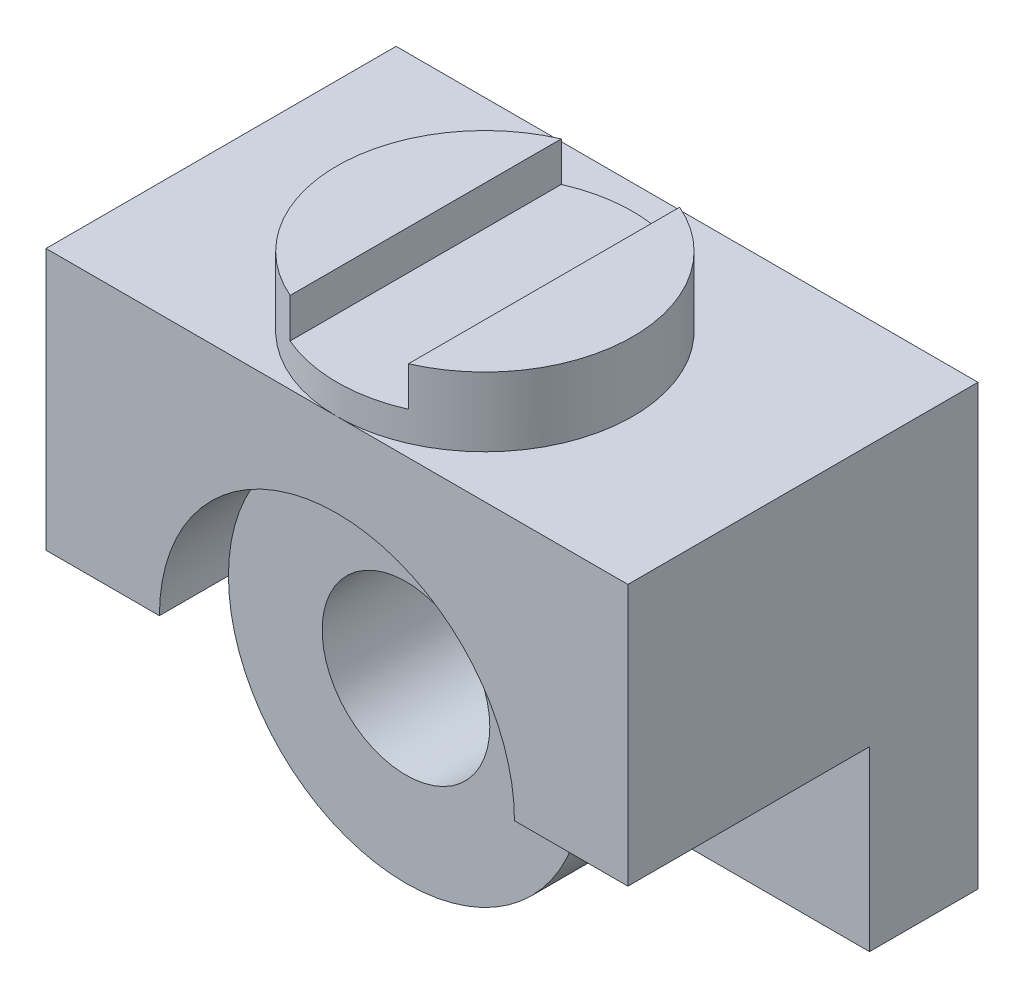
ISO-10303-21;
HEADER;
FILE_DESCRIPTION(('STEP AP214'),'2;1');
FILE_NAME('part.step','',(''),(''),'','','');
FILE_SCHEMA(('AUTOMOTIVE_DESIGN { 1 0 10303 214 1 1 1 1 }'));
ENDSEC;
DATA;
#1=APPLICATION_CONTEXT('core data for automotive mechanical design processes');
#2=APPLICATION_PROTOCOL_DEFINITION('international standard','automotive_design',2000,#1);
#3=PRODUCT_CONTEXT('',#1,'mechanical');
#4=PRODUCT('Part','Part','',(#3));
#5=PRODUCT_RELATED_PRODUCT_CATEGORY('part','',(#4));
#6=PRODUCT_DEFINITION_FORMATION('','',#4);
#7=PRODUCT_DEFINITION_CONTEXT('part definition',#1,'design');
#8=PRODUCT_DEFINITION('design','',#6,#7);
#9=PRODUCT_DEFINITION_SHAPE('','',#8);
#10=(LENGTH_UNIT() NAMED_UNIT(*) SI_UNIT(.MILLI.,.METRE.));
#11=(NAMED_UNIT(*) PLANE_ANGLE_UNIT() SI_UNIT($,.RADIAN.));
#12=(NAMED_UNIT(*) SI_UNIT($,.STERADIAN.) SOLID_ANGLE_UNIT());
#13=UNCERTAINTY_MEASURE_WITH_UNIT(LENGTH_MEASURE(1.E-05),#10,'distance_accuracy_value','');
#14=(GEOMETRIC_REPRESENTATION_CONTEXT(3) GLOBAL_UNCERTAINTY_ASSIGNED_CONTEXT((#13)) GLOBAL_UNIT_ASSIGNED_CONTEXT((#10,
#11,#12)) REPRESENTATION_CONTEXT('',''));
#15=CARTESIAN_POINT('',(0.,0.,0.));
#16=DIRECTION('',(0.,0.,1.));
#17=DIRECTION('',(1.,0.,0.));
#18=AXIS2_PLACEMENT_3D('',#15,#16,#17);
#19=CARTESIAN_POINT('',(0.,134.,0.));
#20=DIRECTION('',(0.,1.,0.));
#21=DIRECTION('',(-1.,0.,0.));
#22=AXIS2_PLACEMENT_3D('',#19,#20,#21);
#23=PLANE('',#22);
#24=DIRECTION('',(0.,0.,-1.));
#25=VECTOR('',#24,1.);
#26=CARTESIAN_POINT('',(24.,134.,0.));
#27=LINE('',#26,#25);
#28=CARTESIAN_POINT('',(24.,134.,54.99090833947));
#29=VERTEX_POINT('',#28);
#30=CARTESIAN_POINT('',(24.,134.,-54.9909083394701));
#31=VERTEX_POINT('',#30);
#32=EDGE_CURVE('E246',#29,#31,#27,.T.);
#33=ORIENTED_EDGE('',*,*,#32,.F.);
#34=CARTESIAN_POINT('',(0.,134.,0.));
#35=DIRECTION('',(0.,1.,0.));
#36=DIRECTION('',(-1.,0.,0.));
#37=AXIS2_PLACEMENT_3D('',#34,#35,#36);
#38=CIRCLE('',#37,60.);
#39=EDGE_CURVE('E160',#29,#31,#38,.T.);
#40=ORIENTED_EDGE('',*,*,#39,.T.);
#41=EDGE_LOOP('',(#33,#40));
#42=FACE_BOUND('',#41,.T.);
#43=ADVANCED_FACE('F31',(#42),#23,.T.);
#44=CARTESIAN_POINT('',(0.,0.,-82.));
#45=DIRECTION('',(0.,0.,1.));
#46=DIRECTION('',(1.,0.,0.));
#47=AXIS2_PLACEMENT_3D('',#44,#45,#46);
#48=CYLINDRICAL_SURFACE('',#47,34.);
#49=CARTESIAN_POINT('',(0.,0.,-82.));
#50=DIRECTION('',(0.,0.,1.));
#51=DIRECTION('',(1.,0.,0.));
#52=AXIS2_PLACEMENT_3D('',#49,#50,#51);
#53=CIRCLE('',#52,34.);
#54=CARTESIAN_POINT('',(34.,0.,-82.));
#55=VERTEX_POINT('',#54);
#56=EDGE_CURVE('E208',#55,#55,#53,.T.);
#57=ORIENTED_EDGE('',*,*,#56,.F.);
#58=EDGE_LOOP('',(#57));
#59=FACE_BOUND('',#58,.T.);
#60=CARTESIAN_POINT('',(0.,0.,32.));
#61=DIRECTION('',(0.,0.,1.));
#62=DIRECTION('',(1.,0.,0.));
#63=AXIS2_PLACEMENT_3D('',#60,#61,#62);
#64=CIRCLE('',#63,34.);
#65=CARTESIAN_POINT('',(34.,0.,32.));
#66=VERTEX_POINT('',#65);
#67=EDGE_CURVE('E163',#66,#66,#64,.T.);
#68=ORIENTED_EDGE('',*,*,#67,.T.);
#69=EDGE_LOOP('',(#68));
#70=FACE_BOUND('',#69,.T.);
#71=ADVANCED_FACE('F254',(#59,#70),#48,.F.);
#72=CARTESIAN_POINT('',(0.,0.,-38.));
#73=DIRECTION('',(0.,0.,1.));
#74=DIRECTION('',(1.,0.,0.));
#75=AXIS2_PLACEMENT_3D('',#72,#73,#74);
#76=CYLINDRICAL_SURFACE('',#75,72.);
#77=DIRECTION('',(0.,0.,1.));
#78=VECTOR('',#77,1.);
#79=CARTESIAN_POINT('',(72.,0.,-38.));
#80=LINE('',#79,#78);
#81=CARTESIAN_POINT('',(72.,0.,-38.));
#82=VERTEX_POINT('',#81);
#83=CARTESIAN_POINT('',(72.,0.,32.));
#84=VERTEX_POINT('',#83);
#85=EDGE_CURVE('E177',#82,#84,#80,.T.);
#86=ORIENTED_EDGE('',*,*,#85,.T.);
#87=CARTESIAN_POINT('',(0.,0.,32.));
#88=DIRECTION('',(0.,0.,1.));
#89=DIRECTION('',(1.,0.,0.));
#90=AXIS2_PLACEMENT_3D('',#87,#88,#89);
#91=CIRCLE('',#90,72.);
#92=CARTESIAN_POINT('',(-72.,0.,32.));
#93=VERTEX_POINT('',#92);
#94=EDGE_CURVE('E166',#93,#84,#91,.T.);
#95=ORIENTED_EDGE('',*,*,#94,.F.);
#96=DIRECTION('',(0.,0.,1.));
#97=VECTOR('',#96,1.);
#98=CARTESIAN_POINT('',(-72.,0.,-38.));
#99=LINE('',#98,#97);
#100=CARTESIAN_POINT('',(-72.,0.,-38.));
#101=VERTEX_POINT('',#100);
#102=EDGE_CURVE('E202',#101,#93,#99,.T.);
#103=ORIENTED_EDGE('',*,*,#102,.F.);
#104=CARTESIAN_POINT('',(0.,0.,-38.));
#105=DIRECTION('',(0.,0.,1.));
#106=DIRECTION('',(1.,0.,0.));
#107=AXIS2_PLACEMENT_3D('',#104,#105,#106);
#108=CIRCLE('',#107,72.);
#109=CARTESIAN_POINT('',(0.,-72.,-38.));
#110=VERTEX_POINT('',#109);
#111=EDGE_CURVE('E192',#101,#110,#108,.T.);
#112=ORIENTED_EDGE('',*,*,#111,.T.);
#113=CARTESIAN_POINT('',(0.,0.,-38.));
#114=DIRECTION('',(0.,0.,1.));
#115=DIRECTION('',(1.,0.,0.));
#116=AXIS2_PLACEMENT_3D('',#113,#114,#115);
#117=CIRCLE('',#116,72.);
#118=EDGE_CURVE('E186',#110,#82,#117,.T.);
#119=ORIENTED_EDGE('',*,*,#118,.T.);
#120=EDGE_LOOP('',(#86,#95,#103,#112,#119));
#121=FACE_BOUND('',#120,.T.);
#122=ADVANCED_FACE('F260',(#121),#76,.T.);
#123=CARTESIAN_POINT('',(-118.,-72.,60.));
#124=DIRECTION('',(0.,0.,1.));
#125=DIRECTION('',(1.,0.,0.));
#126=AXIS2_PLACEMENT_3D('',#123,#124,#125);
#127=PLANE('',#126);
#128=CARTESIAN_POINT('',(0.,0.,60.));
#129=DIRECTION('',(0.,0.,1.));
#130=DIRECTION('',(1.,0.,0.));
#131=AXIS2_PLACEMENT_3D('',#128,#129,#130);
#132=CIRCLE('',#131,72.);
#133=CARTESIAN_POINT('',(72.,0.,60.));
#134=VERTEX_POINT('',#133);
#135=CARTESIAN_POINT('',(-72.,0.,60.));
#136=VERTEX_POINT('',#135);
#137=EDGE_CURVE('E167',#134,#136,#132,.T.);
#138=ORIENTED_EDGE('',*,*,#137,.F.);
#139=DIRECTION('',(1.,0.,0.));
#140=VECTOR('',#139,1.);
#141=CARTESIAN_POINT('',(0.,0.,60.));
#142=LINE('',#141,#140);
#143=CARTESIAN_POINT('',(118.,0.,60.));
#144=VERTEX_POINT('',#143);
#145=EDGE_CURVE('E172',#134,#144,#142,.T.);
#146=ORIENTED_EDGE('',*,*,#145,.T.);
#147=DIRECTION('',(0.,1.,0.));
#148=VECTOR('',#147,1.);
#149=CARTESIAN_POINT('',(118.,106.,60.));
#150=LINE('',#149,#148);
#151=CARTESIAN_POINT('',(118.,106.,60.));
#152=VERTEX_POINT('',#151);
#153=EDGE_CURVE('E216',#144,#152,#150,.T.);
#154=ORIENTED_EDGE('',*,*,#153,.T.);
#155=DIRECTION('',(-1.,0.,0.));
#156=VECTOR('',#155,1.);
#157=CARTESIAN_POINT('',(-118.,106.,60.));
#158=LINE('',#157,#156);
#159=CARTESIAN_POINT('',(0.,106.,60.));
#160=VERTEX_POINT('',#159);
#161=EDGE_CURVE('E219',#152,#160,#158,.T.);
#162=ORIENTED_EDGE('',*,*,#161,.T.);
#163=CARTESIAN_POINT('',(-118.,106.,60.));
#164=VERTEX_POINT('',#163);
#165=EDGE_CURVE('E218',#160,#164,#158,.T.);
#166=ORIENTED_EDGE('',*,*,#165,.T.);
#167=DIRECTION('',(0.,-1.,0.));
#168=VECTOR('',#167,1.);
#169=CARTESIAN_POINT('',(-118.,106.,60.));
#170=LINE('',#169,#168);
#171=CARTESIAN_POINT('',(-118.,0.,60.));
#172=VERTEX_POINT('',#171);
#173=EDGE_CURVE('E213',#164,#172,#170,.T.);
#174=ORIENTED_EDGE('',*,*,#173,.T.);
#175=DIRECTION('',(1.,0.,0.));
#176=VECTOR('',#175,1.);
#177=CARTESIAN_POINT('',(0.,0.,60.));
#178=LINE('',#177,#176);
#179=EDGE_CURVE('E185',#172,#136,#178,.T.);
#180=ORIENTED_EDGE('',*,*,#179,.T.);
#181=EDGE_LOOP('',(#138,#146,#154,#162,#166,#174,#180));
#182=FACE_BOUND('',#181,.T.);
#183=ADVANCED_FACE('F300',(#182),#127,.T.);
#184=CARTESIAN_POINT('',(118.,106.,-82.));
#185=DIRECTION('',(1.,0.,0.));
#186=DIRECTION('',(0.,1.,0.));
#187=AXIS2_PLACEMENT_3D('',#184,#185,#186);
#188=PLANE('',#187);
#189=ORIENTED_EDGE('',*,*,#153,.F.);
#190=DIRECTION('',(0.,0.,1.));
#191=VECTOR('',#190,1.);
#192=CARTESIAN_POINT('',(118.,0.,-38.));
#193=LINE('',#192,#191);
#194=CARTESIAN_POINT('',(118.,0.,-38.));
#195=VERTEX_POINT('',#194);
#196=EDGE_CURVE('E173',#195,#144,#193,.T.);
#197=ORIENTED_EDGE('',*,*,#196,.F.);
#198=DIRECTION('',(0.,1.,0.));
#199=VECTOR('',#198,1.);
#200=CARTESIAN_POINT('',(118.,-213.06510434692,-38.));
#201=LINE('',#200,#199);
#202=CARTESIAN_POINT('',(118.,-72.,-38.));
#203=VERTEX_POINT('',#202);
#204=EDGE_CURVE('E176',#203,#195,#201,.T.);
#205=ORIENTED_EDGE('',*,*,#204,.F.);
#206=DIRECTION('',(0.,0.,1.));
#207=VECTOR('',#206,1.);
#208=CARTESIAN_POINT('',(118.,-72.,-82.));
#209=LINE('',#208,#207);
#210=CARTESIAN_POINT('',(118.,-72.,-82.));
#211=VERTEX_POINT('',#210);
#212=EDGE_CURVE('E241',#211,#203,#209,.T.);
#213=ORIENTED_EDGE('',*,*,#212,.F.);
#214=DIRECTION('',(0.,1.,0.));
#215=VECTOR('',#214,1.);
#216=CARTESIAN_POINT('',(118.,106.,-82.));
#217=LINE('',#216,#215);
#218=CARTESIAN_POINT('',(118.,106.,-82.));
#219=VERTEX_POINT('',#218);
#220=EDGE_CURVE('E227',#211,#219,#217,.T.);
#221=ORIENTED_EDGE('',*,*,#220,.T.);
#222=DIRECTION('',(0.,0.,1.));
#223=VECTOR('',#222,1.);
#224=CARTESIAN_POINT('',(118.,106.,-82.));
#225=LINE('',#224,#223);
#226=EDGE_CURVE('E238',#219,#152,#225,.T.);
#227=ORIENTED_EDGE('',*,*,#226,.T.);
#228=EDGE_LOOP('',(#189,#197,#205,#213,#221,#227));
#229=FACE_BOUND('',#228,.T.);
#230=ADVANCED_FACE('F305',(#229),#188,.T.);
#231=CARTESIAN_POINT('',(-118.,-72.,-82.));
#232=DIRECTION('',(0.,-1.,0.));
#233=DIRECTION('',(1.,0.,0.));
#234=AXIS2_PLACEMENT_3D('',#231,#232,#233);
#235=PLANE('',#234);
#236=ORIENTED_EDGE('',*,*,#212,.T.);
#237=DIRECTION('',(1.,0.,0.));
#238=VECTOR('',#237,1.);
#239=CARTESIAN_POINT('',(0.,-72.,-38.));
#240=LINE('',#239,#238);
#241=EDGE_CURVE('E175',#110,#203,#240,.T.);
#242=ORIENTED_EDGE('',*,*,#241,.F.);
#243=DIRECTION('',(1.,0.,0.));
#244=VECTOR('',#243,1.);
#245=CARTESIAN_POINT('',(0.,-72.,-38.));
#246=LINE('',#245,#244);
#247=CARTESIAN_POINT('',(-118.,-72.,-38.));
#248=VERTEX_POINT('',#247);
#249=EDGE_CURVE('E199',#248,#110,#246,.T.);
#250=ORIENTED_EDGE('',*,*,#249,.F.);
#251=DIRECTION('',(0.,0.,1.));
#252=VECTOR('',#251,1.);
#253=CARTESIAN_POINT('',(-118.,-72.,-82.));
#254=LINE('',#253,#252);
#255=CARTESIAN_POINT('',(-118.,-72.,-82.));
#256=VERTEX_POINT('',#255);
#257=EDGE_CURVE('E233',#256,#248,#254,.T.);
#258=ORIENTED_EDGE('',*,*,#257,.F.);
#259=DIRECTION('',(1.,0.,0.));
#260=VECTOR('',#259,1.);
#261=CARTESIAN_POINT('',(-118.,-72.,-82.));
#262=LINE('',#261,#260);
#263=EDGE_CURVE('E224',#256,#211,#262,.T.);
#264=ORIENTED_EDGE('',*,*,#263,.T.);
#265=EDGE_LOOP('',(#236,#242,#250,#258,#264));
#266=FACE_BOUND('',#265,.T.);
#267=ADVANCED_FACE('F315',(#266),#235,.T.);
#268=CARTESIAN_POINT('',(-118.,106.,-82.));
#269=DIRECTION('',(-1.,0.,0.));
#270=DIRECTION('',(0.,-1.,0.));
#271=AXIS2_PLACEMENT_3D('',#268,#269,#270);
#272=PLANE('',#271);
#273=DIRECTION('',(0.,-1.,0.));
#274=VECTOR('',#273,1.);
#275=CARTESIAN_POINT('',(-118.,-213.06510434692,-38.));
#276=LINE('',#275,#274);
#277=CARTESIAN_POINT('',(-118.,0.,-38.));
#278=VERTEX_POINT('',#277);
#279=EDGE_CURVE('E197',#278,#248,#276,.T.);
#280=ORIENTED_EDGE('',*,*,#279,.F.);
#281=DIRECTION('',(0.,0.,1.));
#282=VECTOR('',#281,1.);
#283=CARTESIAN_POINT('',(-118.,0.,-38.));
#284=LINE('',#283,#282);
#285=EDGE_CURVE('E205',#278,#172,#284,.T.);
#286=ORIENTED_EDGE('',*,*,#285,.T.);
#287=ORIENTED_EDGE('',*,*,#173,.F.);
#288=DIRECTION('',(0.,0.,1.));
#289=VECTOR('',#288,1.);
#290=CARTESIAN_POINT('',(-118.,106.,-82.));
#291=LINE('',#290,#289);
#292=CARTESIAN_POINT('',(-118.,106.,-82.));
#293=VERTEX_POINT('',#292);
#294=EDGE_CURVE('E234',#293,#164,#291,.T.);
#295=ORIENTED_EDGE('',*,*,#294,.F.);
#296=DIRECTION('',(0.,-1.,0.));
#297=VECTOR('',#296,1.);
#298=CARTESIAN_POINT('',(-118.,106.,-82.));
#299=LINE('',#298,#297);
#300=EDGE_CURVE('E221',#293,#256,#299,.T.);
#301=ORIENTED_EDGE('',*,*,#300,.T.);
#302=ORIENTED_EDGE('',*,*,#257,.T.);
#303=EDGE_LOOP('',(#280,#286,#287,#295,#301,#302));
#304=FACE_BOUND('',#303,.T.);
#305=ADVANCED_FACE('F33',(#304),#272,.T.);
#306=CARTESIAN_POINT('',(-118.,106.,-82.));
#307=DIRECTION('',(0.,1.,0.));
#308=DIRECTION('',(-1.,0.,0.));
#309=AXIS2_PLACEMENT_3D('',#306,#307,#308);
#310=PLANE('',#309);
#311=ORIENTED_EDGE('',*,*,#165,.F.);
#312=CARTESIAN_POINT('',(0.,106.,0.));
#313=DIRECTION('',(0.,1.,0.));
#314=DIRECTION('',(-1.,0.,0.));
#315=AXIS2_PLACEMENT_3D('',#312,#313,#314);
#316=CIRCLE('',#315,60.);
#317=EDGE_CURVE('E158',#160,#160,#316,.T.);
#318=ORIENTED_EDGE('',*,*,#317,.F.);
#319=ORIENTED_EDGE('',*,*,#161,.F.);
#320=ORIENTED_EDGE('',*,*,#226,.F.);
#321=DIRECTION('',(-1.,0.,0.));
#322=VECTOR('',#321,1.);
#323=CARTESIAN_POINT('',(-118.,106.,-82.));
#324=LINE('',#323,#322);
#325=EDGE_CURVE('E230',#219,#293,#324,.T.);
#326=ORIENTED_EDGE('',*,*,#325,.T.);
#327=ORIENTED_EDGE('',*,*,#294,.T.);
#328=EDGE_LOOP('',(#311,#318,#319,#320,#326,#327));
#329=FACE_BOUND('',#328,.T.);
#330=ADVANCED_FACE('F309',(#329),#310,.T.);
#331=CARTESIAN_POINT('',(-118.,-72.,-82.));
#332=DIRECTION('',(0.,0.,1.));
#333=DIRECTION('',(1.,0.,0.));
#334=AXIS2_PLACEMENT_3D('',#331,#332,#333);
#335=PLANE('',#334);
#336=ORIENTED_EDGE('',*,*,#56,.T.);
#337=EDGE_LOOP('',(#336));
#338=FACE_BOUND('',#337,.T.);
#339=ORIENTED_EDGE('',*,*,#300,.F.);
#340=ORIENTED_EDGE('',*,*,#325,.F.);
#341=ORIENTED_EDGE('',*,*,#220,.F.);
#342=ORIENTED_EDGE('',*,*,#263,.F.);
#343=EDGE_LOOP('',(#339,#340,#341,#342));
#344=FACE_BOUND('',#343,.T.);
#345=ADVANCED_FACE('F297',(#338,#344),#335,.F.);
#346=CARTESIAN_POINT('',(0.,0.,-38.));
#347=DIRECTION('',(0.,-1.,0.));
#348=DIRECTION('',(0.,0.,-1.));
#349=AXIS2_PLACEMENT_3D('',#346,#347,#348);
#350=PLANE('',#349);
#351=ORIENTED_EDGE('',*,*,#179,.F.);
#352=ORIENTED_EDGE('',*,*,#285,.F.);
#353=DIRECTION('',(1.,0.,0.));
#354=VECTOR('',#353,1.);
#355=CARTESIAN_POINT('',(0.,0.,-38.));
#356=LINE('',#355,#354);
#357=EDGE_CURVE('E195',#278,#101,#356,.T.);
#358=ORIENTED_EDGE('',*,*,#357,.T.);
#359=ORIENTED_EDGE('',*,*,#102,.T.);
#360=DIRECTION('',(0.,0.,1.));
#361=VECTOR('',#360,1.);
#362=CARTESIAN_POINT('',(-72.,0.,32.));
#363=LINE('',#362,#361);
#364=EDGE_CURVE('E169',#136,#93,#363,.F.);
#365=ORIENTED_EDGE('',*,*,#364,.F.);
#366=EDGE_LOOP('',(#351,#352,#358,#359,#365));
#367=FACE_BOUND('',#366,.T.);
#368=ADVANCED_FACE('F293',(#367),#350,.T.);
#369=CARTESIAN_POINT('',(0.,-213.06510434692,-38.));
#370=DIRECTION('',(0.,0.,1.));
#371=DIRECTION('',(1.,0.,0.));
#372=AXIS2_PLACEMENT_3D('',#369,#370,#371);
#373=PLANE('',#372);
#374=ORIENTED_EDGE('',*,*,#111,.F.);
#375=ORIENTED_EDGE('',*,*,#357,.F.);
#376=ORIENTED_EDGE('',*,*,#279,.T.);
#377=ORIENTED_EDGE('',*,*,#249,.T.);
#378=EDGE_LOOP('',(#374,#375,#376,#377));
#379=FACE_BOUND('',#378,.T.);
#380=ADVANCED_FACE('F286',(#379),#373,.T.);
#381=CARTESIAN_POINT('',(0.,0.,-38.));
#382=DIRECTION('',(0.,-1.,0.));
#383=DIRECTION('',(0.,0.,-1.));
#384=AXIS2_PLACEMENT_3D('',#381,#382,#383);
#385=PLANE('',#384);
#386=ORIENTED_EDGE('',*,*,#145,.F.);
#387=EDGE_CURVE('E180',#84,#134,#80,.T.);
#388=ORIENTED_EDGE('',*,*,#387,.F.);
#389=ORIENTED_EDGE('',*,*,#85,.F.);
#390=DIRECTION('',(1.,0.,0.));
#391=VECTOR('',#390,1.);
#392=CARTESIAN_POINT('',(0.,0.,-38.));
#393=LINE('',#392,#391);
#394=EDGE_CURVE('E183',#82,#195,#393,.T.);
#395=ORIENTED_EDGE('',*,*,#394,.T.);
#396=ORIENTED_EDGE('',*,*,#196,.T.);
#397=EDGE_LOOP('',(#386,#388,#389,#395,#396));
#398=FACE_BOUND('',#397,.T.);
#399=ADVANCED_FACE('F283',(#398),#385,.T.);
#400=CARTESIAN_POINT('',(0.,-213.06510434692,-38.));
#401=DIRECTION('',(0.,0.,1.));
#402=DIRECTION('',(1.,0.,0.));
#403=AXIS2_PLACEMENT_3D('',#400,#401,#402);
#404=PLANE('',#403);
#405=ORIENTED_EDGE('',*,*,#118,.F.);
#406=ORIENTED_EDGE('',*,*,#241,.T.);
#407=ORIENTED_EDGE('',*,*,#204,.T.);
#408=ORIENTED_EDGE('',*,*,#394,.F.);
#409=EDGE_LOOP('',(#405,#406,#407,#408));
#410=FACE_BOUND('',#409,.T.);
#411=ADVANCED_FACE('F282',(#410),#404,.T.);
#412=CARTESIAN_POINT('',(0.,0.,32.));
#413=DIRECTION('',(0.,0.,1.));
#414=DIRECTION('',(1.,0.,0.));
#415=AXIS2_PLACEMENT_3D('',#412,#413,#414);
#416=CYLINDRICAL_SURFACE('',#415,72.);
#417=ORIENTED_EDGE('',*,*,#364,.T.);
#418=EDGE_CURVE('E54',#84,#93,#91,.T.);
#419=ORIENTED_EDGE('',*,*,#418,.F.);
#420=ORIENTED_EDGE('',*,*,#387,.T.);
#421=ORIENTED_EDGE('',*,*,#137,.T.);
#422=EDGE_LOOP('',(#417,#419,#420,#421));
#423=FACE_BOUND('',#422,.T.);
#424=ADVANCED_FACE('F276',(#423),#416,.F.);
#425=CARTESIAN_POINT('',(0.,-213.06510434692,32.));
#426=DIRECTION('',(0.,0.,1.));
#427=DIRECTION('',(1.,0.,0.));
#428=AXIS2_PLACEMENT_3D('',#425,#426,#427);
#429=PLANE('',#428);
#430=ORIENTED_EDGE('',*,*,#67,.F.);
#431=EDGE_LOOP('',(#430));
#432=FACE_BOUND('',#431,.T.);
#433=ORIENTED_EDGE('',*,*,#418,.T.);
#434=ORIENTED_EDGE('',*,*,#94,.T.);
#435=EDGE_LOOP('',(#433,#434));
#436=FACE_BOUND('',#435,.T.);
#437=ADVANCED_FACE('F272',(#432,#436),#429,.T.);
#438=CARTESIAN_POINT('',(0.,134.,0.));
#439=DIRECTION('',(0.,-1.,0.));
#440=DIRECTION('',(1.,0.,0.));
#441=AXIS2_PLACEMENT_3D('',#438,#439,#440);
#442=CYLINDRICAL_SURFACE('',#441,60.);
#443=ORIENTED_EDGE('',*,*,#39,.F.);
#444=DIRECTION('',(0.,-1.,0.));
#445=VECTOR('',#444,1.);
#446=CARTESIAN_POINT('',(24.,134.,54.9909083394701));
#447=LINE('',#446,#445);
#448=CARTESIAN_POINT('',(24.,118.,54.9909083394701));
#449=VERTEX_POINT('',#448);
#450=EDGE_CURVE('E152',#29,#449,#447,.T.);
#451=ORIENTED_EDGE('',*,*,#450,.T.);
#452=CARTESIAN_POINT('',(0.,118.,0.));
#453=DIRECTION('',(0.,-1.,0.));
#454=DIRECTION('',(0.,0.,-1.));
#455=AXIS2_PLACEMENT_3D('',#452,#453,#454);
#456=CIRCLE('',#455,60.);
#457=CARTESIAN_POINT('',(-24.,118.,54.99090833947));
#458=VERTEX_POINT('',#457);
#459=EDGE_CURVE('E35',#449,#458,#456,.T.);
#460=ORIENTED_EDGE('',*,*,#459,.T.);
#461=DIRECTION('',(0.,-1.,0.));
#462=VECTOR('',#461,1.);
#463=CARTESIAN_POINT('',(-24.,134.,54.9909083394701));
#464=LINE('',#463,#462);
#465=CARTESIAN_POINT('',(-24.,134.,54.99090833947));
#466=VERTEX_POINT('',#465);
#467=EDGE_CURVE('E142',#458,#466,#464,.F.);
#468=ORIENTED_EDGE('',*,*,#467,.T.);
#469=CARTESIAN_POINT('',(-24.,134.,-54.9909083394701));
#470=VERTEX_POINT('',#469);
#471=EDGE_CURVE('E149',#470,#466,#38,.T.);
#472=ORIENTED_EDGE('',*,*,#471,.F.);
#473=DIRECTION('',(0.,-1.,0.));
#474=VECTOR('',#473,1.);
#475=CARTESIAN_POINT('',(-24.,134.,-54.9909083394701));
#476=LINE('',#475,#474);
#477=CARTESIAN_POINT('',(-24.,118.,-54.9909083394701));
#478=VERTEX_POINT('',#477);
#479=EDGE_CURVE('E46',#470,#478,#476,.T.);
#480=ORIENTED_EDGE('',*,*,#479,.T.);
#481=CARTESIAN_POINT('',(24.,118.,-54.9909083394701));
#482=VERTEX_POINT('',#481);
#483=EDGE_CURVE('E11',#478,#482,#456,.T.);
#484=ORIENTED_EDGE('',*,*,#483,.T.);
#485=DIRECTION('',(0.,-1.,0.));
#486=VECTOR('',#485,1.);
#487=CARTESIAN_POINT('',(24.,134.,-54.9909083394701));
#488=LINE('',#487,#486);
#489=EDGE_CURVE('E150',#482,#31,#488,.F.);
#490=ORIENTED_EDGE('',*,*,#489,.T.);
#491=EDGE_LOOP('',(#443,#451,#460,#468,#472,#480,#484,#490));
#492=FACE_BOUND('',#491,.T.);
#493=ORIENTED_EDGE('',*,*,#317,.T.);
#494=EDGE_LOOP('',(#493));
#495=FACE_BOUND('',#494,.T.);
#496=ADVANCED_FACE('F146',(#492,#495),#442,.T.);
#497=DIRECTION('',(0.,0.,1.));
#498=VECTOR('',#497,1.);
#499=CARTESIAN_POINT('',(-24.,134.,0.));
#500=LINE('',#499,#498);
#501=EDGE_CURVE('E237',#470,#466,#500,.T.);
#502=ORIENTED_EDGE('',*,*,#501,.F.);
#503=ORIENTED_EDGE('',*,*,#471,.T.);
#504=EDGE_LOOP('',(#502,#503));
#505=FACE_BOUND('',#504,.T.);
#506=ADVANCED_FACE('F256',(#505),#23,.T.);
#507=CARTESIAN_POINT('',(-24.,118.,-82.));
#508=DIRECTION('',(0.,-1.,0.));
#509=DIRECTION('',(0.,0.,-1.));
#510=AXIS2_PLACEMENT_3D('',#507,#508,#509);
#511=PLANE('',#510);
#512=DIRECTION('',(0.,0.,1.));
#513=VECTOR('',#512,1.);
#514=CARTESIAN_POINT('',(24.,118.,-82.));
#515=LINE('',#514,#513);
#516=EDGE_CURVE('E137',#482,#449,#515,.T.);
#517=ORIENTED_EDGE('',*,*,#516,.F.);
#518=ORIENTED_EDGE('',*,*,#483,.F.);
#519=DIRECTION('',(0.,0.,1.));
#520=VECTOR('',#519,1.);
#521=CARTESIAN_POINT('',(-24.,118.,-82.));
#522=LINE('',#521,#520);
#523=EDGE_CURVE('E134',#478,#458,#522,.T.);
#524=ORIENTED_EDGE('',*,*,#523,.T.);
#525=ORIENTED_EDGE('',*,*,#459,.F.);
#526=EDGE_LOOP('',(#517,#518,#524,#525));
#527=FACE_BOUND('',#526,.T.);
#528=ADVANCED_FACE('F133',(#527),#511,.F.);
#529=CARTESIAN_POINT('',(24.,118.,-82.));
#530=DIRECTION('',(1.,0.,0.));
#531=DIRECTION('',(0.,1.,0.));
#532=AXIS2_PLACEMENT_3D('',#529,#530,#531);
#533=PLANE('',#532);
#534=ORIENTED_EDGE('',*,*,#32,.T.);
#535=ORIENTED_EDGE('',*,*,#489,.F.);
#536=ORIENTED_EDGE('',*,*,#516,.T.);
#537=ORIENTED_EDGE('',*,*,#450,.F.);
#538=EDGE_LOOP('',(#534,#535,#536,#537));
#539=FACE_BOUND('',#538,.T.);
#540=ADVANCED_FACE('F249',(#539),#533,.F.);
#541=CARTESIAN_POINT('',(-24.,134.,-82.));
#542=DIRECTION('',(-1.,0.,0.));
#543=DIRECTION('',(0.,-1.,0.));
#544=AXIS2_PLACEMENT_3D('',#541,#542,#543);
#545=PLANE('',#544);
#546=ORIENTED_EDGE('',*,*,#501,.T.);
#547=ORIENTED_EDGE('',*,*,#467,.F.);
#548=ORIENTED_EDGE('',*,*,#523,.F.);
#549=ORIENTED_EDGE('',*,*,#479,.F.);
#550=EDGE_LOOP('',(#546,#547,#548,#549));
#551=FACE_BOUND('',#550,.T.);
#552=ADVANCED_FACE('F140',(#551),#545,.F.);
#553=CLOSED_SHELL('',(#43,#71,#122,#183,#230,#267,#305,#330,#345,#368,#380,#399,#411,#424,#437,
#496,#506,#528,#540,#552));
#554=MANIFOLD_SOLID_BREP('B2',#553);
#555=ADVANCED_BREP_SHAPE_REPRESENTATION('',(#18,#554),#14);
#556=SHAPE_DEFINITION_REPRESENTATION(#9,#555);
ENDSEC;
END-ISO-10303-21;
